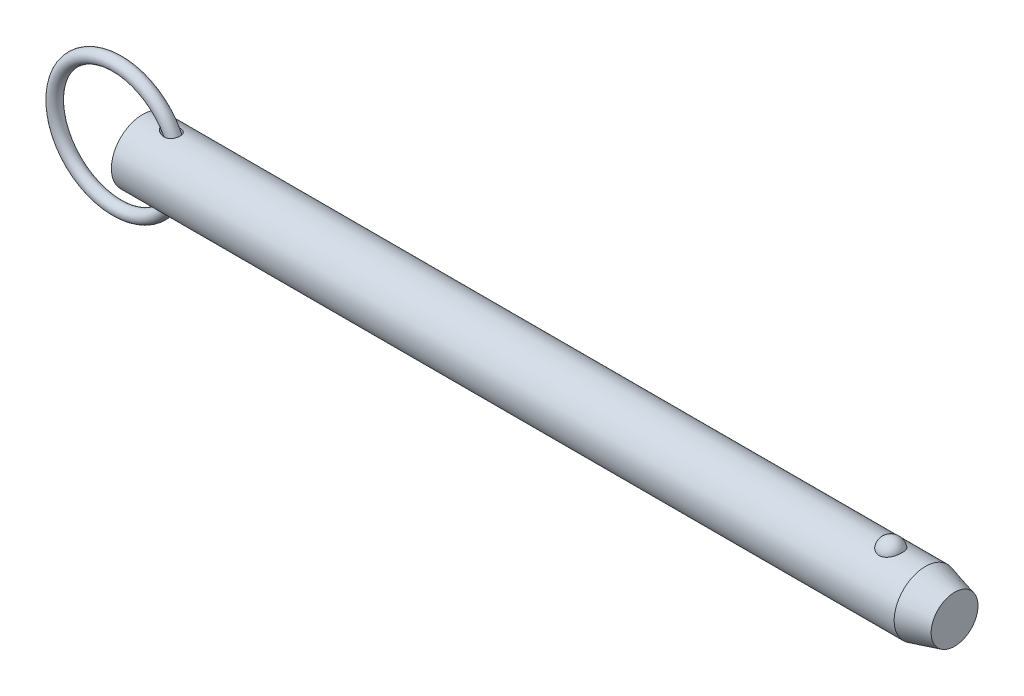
ISO-10303-21;
HEADER;
FILE_DESCRIPTION(('STEP AP214'),'2;1');
FILE_NAME('part.step','',(''),(''),'','','');
FILE_SCHEMA(('AUTOMOTIVE_DESIGN { 1 0 10303 214 1 1 1 1 }'));
ENDSEC;
DATA;
#1=APPLICATION_CONTEXT('core data for automotive mechanical design processes');
#2=APPLICATION_PROTOCOL_DEFINITION('international standard','automotive_design',2000,#1);
#3=PRODUCT_CONTEXT('',#1,'mechanical');
#4=PRODUCT('Part','Part','',(#3));
#5=PRODUCT_RELATED_PRODUCT_CATEGORY('part','',(#4));
#6=PRODUCT_DEFINITION_FORMATION('','',#4);
#7=PRODUCT_DEFINITION_CONTEXT('part definition',#1,'design');
#8=PRODUCT_DEFINITION('design','',#6,#7);
#9=PRODUCT_DEFINITION_SHAPE('','',#8);
#10=(LENGTH_UNIT() NAMED_UNIT(*) SI_UNIT(.MILLI.,.METRE.));
#11=(NAMED_UNIT(*) PLANE_ANGLE_UNIT() SI_UNIT($,.RADIAN.));
#12=(NAMED_UNIT(*) SI_UNIT($,.STERADIAN.) SOLID_ANGLE_UNIT());
#13=UNCERTAINTY_MEASURE_WITH_UNIT(LENGTH_MEASURE(1.E-05),#10,'distance_accuracy_value','');
#14=(GEOMETRIC_REPRESENTATION_CONTEXT(3) GLOBAL_UNCERTAINTY_ASSIGNED_CONTEXT((#13)) GLOBAL_UNIT_ASSIGNED_CONTEXT((#10,
#11,#12)) REPRESENTATION_CONTEXT('',''));
#15=CARTESIAN_POINT('',(0.,0.,0.));
#16=DIRECTION('',(0.,0.,1.));
#17=DIRECTION('',(1.,0.,0.));
#18=AXIS2_PLACEMENT_3D('',#15,#16,#17);
#19=CARTESIAN_POINT('',(-6.46799987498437,0.,0.));
#20=DIRECTION('',(0.,0.,1.));
#21=DIRECTION('',(1.,0.,0.));
#22=AXIS2_PLACEMENT_3D('',#19,#20,#21);
#23=TOROIDAL_SURFACE('',#22,15.875,1.588);
#24=CARTESIAN_POINT('',(10.9950001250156,0.,0.));
#25=VERTEX_POINT('',#24);
#26=VERTEX_LOOP('',#25);
#27=FACE_BOUND('',#26,.T.);
#28=ADVANCED_FACE('P0_F12',(#27),#23,.T.);
#29=CLOSED_SHELL('',(#28));
#30=MANIFOLD_SOLID_BREP('P0_B1',#29);
#31=CARTESIAN_POINT('',(0.,0.,0.));
#32=DIRECTION('',(1.,0.,0.));
#33=DIRECTION('',(0.,0.,-1.));
#34=AXIS2_PLACEMENT_3D('',#31,#32,#33);
#35=CYLINDRICAL_SURFACE('',#34,7.94);
#36=CARTESIAN_POINT('',(4.99454278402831,7.92831028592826,-0.430692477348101));
#37=CARTESIAN_POINT('',(5.02621962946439,7.92271974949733,-0.533554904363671));
#38=CARTESIAN_POINT('',(5.06869972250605,7.91528872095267,-0.633052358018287));
#39=CARTESIAN_POINT('',(5.17094751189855,7.89785690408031,-0.822566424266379));
#40=CARTESIAN_POINT('',(5.23077290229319,7.88784755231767,-0.912550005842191));
#41=CARTESIAN_POINT('',(5.37866013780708,7.8639674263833,-1.10117829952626));
#42=CARTESIAN_POINT('',(5.47004908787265,7.84973599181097,-1.19714712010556));
#43=CARTESIAN_POINT('',(5.66695490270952,7.82090787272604,-1.37293476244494));
#44=CARTESIAN_POINT('',(5.77247743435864,7.80631104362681,-1.45274707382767));
#45=CARTESIAN_POINT('',(5.99604254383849,7.77793596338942,-1.59776875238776));
#46=CARTESIAN_POINT('',(6.11428384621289,7.76417836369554,-1.66267404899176));
#47=CARTESIAN_POINT('',(6.35882685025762,7.73912410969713,-1.77564129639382));
#48=CARTESIAN_POINT('',(6.48513256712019,7.72782869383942,-1.82369477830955));
#49=CARTESIAN_POINT('',(6.76898453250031,7.70705630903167,-1.90977520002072));
#50=CARTESIAN_POINT('',(6.92778004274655,7.69837706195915,-1.94395681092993));
#51=CARTESIAN_POINT('',(7.24915504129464,7.6881294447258,-1.98412381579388));
#52=CARTESIAN_POINT('',(7.41173039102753,7.68655363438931,-1.99013871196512));
#53=CARTESIAN_POINT('',(7.697714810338,7.69094561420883,-1.97306069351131));
#54=CARTESIAN_POINT('',(7.82153338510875,7.69526202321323,-1.95634328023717));
#55=CARTESIAN_POINT('',(8.06460511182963,7.70859273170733,-1.90314615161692));
#56=CARTESIAN_POINT('',(8.18386164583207,7.7176034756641,-1.86668139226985));
#57=CARTESIAN_POINT('',(8.41450663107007,7.73959050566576,-1.77331230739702));
#58=CARTESIAN_POINT('',(8.52585042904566,7.75258738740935,-1.71630154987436));
#59=CARTESIAN_POINT('',(8.73575290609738,7.7809705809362,-1.58263416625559));
#60=CARTESIAN_POINT('',(8.83431445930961,7.7963563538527,-1.50598196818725));
#61=CARTESIAN_POINT('',(9.00639839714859,7.8259635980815,-1.34315626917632));
#62=CARTESIAN_POINT('',(9.08139772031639,7.84016008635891,-1.25853389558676));
#63=CARTESIAN_POINT('',(9.21545590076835,7.86710959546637,-1.07729126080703));
#64=CARTESIAN_POINT('',(9.27451869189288,7.87986297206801,-0.980673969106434));
#65=CARTESIAN_POINT('',(9.37315031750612,7.90198817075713,-0.782161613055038));
#66=CARTESIAN_POINT('',(9.41336512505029,7.91146854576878,-0.68059867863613));
#67=CARTESIAN_POINT('',(9.47650914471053,7.92664976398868,-0.471967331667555));
#68=CARTESIAN_POINT('',(9.49943917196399,7.93235078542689,-0.364899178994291));
#69=CARTESIAN_POINT('',(9.5274466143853,7.93934369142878,-0.14863226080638));
#70=CARTESIAN_POINT('',(9.53257574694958,7.9406483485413,-0.0394405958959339));
#71=CARTESIAN_POINT('',(9.52501411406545,7.93874464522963,0.178286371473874));
#72=CARTESIAN_POINT('',(9.51232314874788,7.93553623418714,0.286821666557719));
#73=CARTESIAN_POINT('',(9.46937875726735,7.92494527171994,0.500278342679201));
#74=CARTESIAN_POINT('',(9.43910562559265,7.9175580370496,0.605195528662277));
#75=CARTESIAN_POINT('',(9.36168926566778,7.8994090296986,0.808294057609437));
#76=CARTESIAN_POINT('',(9.3145467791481,7.88864740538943,0.906475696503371));
#77=CARTESIAN_POINT('',(9.20464679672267,7.86494645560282,1.09319438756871));
#78=CARTESIAN_POINT('',(9.14191093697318,7.85201015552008,1.18174456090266));
#79=CARTESIAN_POINT('',(9.00249124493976,7.82536913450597,1.34692675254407));
#80=CARTESIAN_POINT('',(8.92580850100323,7.81166447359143,1.42355969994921));
#81=CARTESIAN_POINT('',(8.76033130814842,7.78490157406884,1.56333296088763));
#82=CARTESIAN_POINT('',(8.67148512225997,7.77184644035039,1.62641250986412));
#83=CARTESIAN_POINT('',(8.48457694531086,7.74778101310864,1.73744892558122));
#84=CARTESIAN_POINT('',(8.38651410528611,7.73677090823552,1.78540439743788));
#85=CARTESIAN_POINT('',(8.18013312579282,7.71742695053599,1.86728938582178));
#86=CARTESIAN_POINT('',(8.07156725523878,7.7092102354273,1.90061897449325));
#87=CARTESIAN_POINT('',(7.85050876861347,7.6966502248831,1.95085652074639));
#88=CARTESIAN_POINT('',(7.73801453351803,7.69230854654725,1.967757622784));
#89=CARTESIAN_POINT('',(7.50002163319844,7.6873799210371,1.98693391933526));
#90=CARTESIAN_POINT('',(7.37438052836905,7.68722739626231,1.98751701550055));
#91=CARTESIAN_POINT('',(7.12435864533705,7.69142268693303,1.97121025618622));
#92=CARTESIAN_POINT('',(6.99997834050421,7.6957721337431,1.9543140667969));
#93=CARTESIAN_POINT('',(6.73521978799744,7.70925573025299,1.90049277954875));
#94=CARTESIAN_POINT('',(6.59543541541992,7.71903968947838,1.86081454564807));
#95=CARTESIAN_POINT('',(6.32319848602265,7.74233460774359,1.76138158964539));
#96=CARTESIAN_POINT('',(6.19076082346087,7.75585282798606,1.7015877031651));
#97=CARTESIAN_POINT('',(5.99269110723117,7.7785835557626,1.59336057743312));
#98=CARTESIAN_POINT('',(5.92332049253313,7.78707101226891,1.55151799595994));
#99=CARTESIAN_POINT('',(5.78862576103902,7.80440479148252,1.46183267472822));
#100=CARTESIAN_POINT('',(5.72330291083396,7.81325122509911,1.41398807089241));
#101=CARTESIAN_POINT('',(5.53492618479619,7.83980388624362,1.26162857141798));
#102=CARTESIAN_POINT('',(5.41884115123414,7.85759887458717,1.14795556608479));
#103=CARTESIAN_POINT('',(5.25731156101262,7.88350844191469,0.948390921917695));
#104=CARTESIAN_POINT('',(5.20241173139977,7.89260196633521,0.87019982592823));
#105=CARTESIAN_POINT('',(5.10541071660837,7.90897737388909,0.70602680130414));
#106=CARTESIAN_POINT('',(5.06329682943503,7.91626105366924,0.620052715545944));
#107=CARTESIAN_POINT('',(4.99458837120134,7.92827352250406,0.440665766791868));
#108=CARTESIAN_POINT('',(4.96816655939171,7.93297382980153,0.347182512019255));
#109=CARTESIAN_POINT('',(4.94275291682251,7.93751024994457,0.204498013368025));
#110=CARTESIAN_POINT('',(4.93665149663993,7.9386033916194,0.156529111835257));
#111=CARTESIAN_POINT('',(4.92932198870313,7.93991739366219,0.0602142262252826));
#112=CARTESIAN_POINT('',(4.92809242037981,7.94013851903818,0.011868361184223));
#113=CARTESIAN_POINT('',(4.93104052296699,7.93960920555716,-0.103241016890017));
#114=CARTESIAN_POINT('',(4.93747289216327,7.93845361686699,-0.169956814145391));
#115=CARTESIAN_POINT('',(4.95939910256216,7.93453812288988,-0.301777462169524));
#116=CARTESIAN_POINT('',(4.97489225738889,7.9317783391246,-0.36688243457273));
#117=CARTESIAN_POINT('',(4.99454278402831,7.92831028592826,-0.430692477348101));
#118=B_SPLINE_CURVE_WITH_KNOTS('',3,(#36,#37,#38,#39,#40,#41,#42,#43,#44,#45,#46,#47,#48,#49,
#50,#51,#52,#53,#54,#55,#56,#57,#58,#59,#60,#61,#62,#63,#64,#65,#66,#67,#68,#69,#70,#71,#72,#73,
#74,#75,#76,#77,#78,#79,#80,#81,#82,#83,#84,#85,#86,#87,#88,#89,#90,#91,#92,#93,#94,#95,#96,#97,
#98,#99,#100,#101,#102,#103,#104,#105,#106,#107,#108,#109,#110,#111,#112,#113,#114,#115,#116,
#117),.UNSPECIFIED.,.T.,.F.,(4,2,2,2,2,2,2,2,2,2,2,2,2,2,2,2,2,2,2,2,2,2,2,2,2,2,2,2,2,2,2,2,2,
2,2,2,2,2,2,2,4),(0.,0.323000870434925,0.647088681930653,1.04479679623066,1.4426648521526,
1.84804279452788,2.25362416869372,2.73917777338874,3.2242226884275,3.59772765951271,
3.97095014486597,4.34613445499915,4.72123425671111,5.06140749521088,5.40149668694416,
5.72887751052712,6.05624289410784,6.38265637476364,6.70907351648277,7.03585720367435,
7.36262652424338,7.68894495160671,8.01523792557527,8.34296459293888,8.67072147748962,
9.01089033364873,9.35120108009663,9.72668268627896,10.1023004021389,10.5375309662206,
10.9736138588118,11.2176803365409,11.461822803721,11.9480055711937,12.2349837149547,
12.5216758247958,12.8114683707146,12.9563497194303,13.1011870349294,13.3015737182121,
13.5019452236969),.UNSPECIFIED.);
#119=CARTESIAN_POINT('',(4.99454278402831,7.92831028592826,-0.430692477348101));
#120=VERTEX_POINT('',#119);
#121=EDGE_CURVE('P1_E40',#120,#120,#118,.T.);
#122=ORIENTED_EDGE('',*,*,#121,.T.);
#123=EDGE_LOOP('',(#122));
#124=FACE_BOUND('',#123,.T.);
#125=CARTESIAN_POINT('',(198.971879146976,0.,0.));
#126=DIRECTION('',(1.,0.,0.));
#127=DIRECTION('',(0.,0.,-1.));
#128=AXIS2_PLACEMENT_3D('',#125,#126,#127);
#129=CIRCLE('',#128,7.94);
#130=CARTESIAN_POINT('',(198.971879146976,0.,-7.94));
#131=VERTEX_POINT('',#130);
#132=EDGE_CURVE('P1_E25',#131,#131,#129,.T.);
#133=ORIENTED_EDGE('',*,*,#132,.F.);
#134=EDGE_LOOP('',(#133));
#135=FACE_BOUND('',#134,.T.);
#136=CARTESIAN_POINT('',(0.,0.,0.));
#137=DIRECTION('',(1.,0.,0.));
#138=DIRECTION('',(0.,0.,-1.));
#139=AXIS2_PLACEMENT_3D('',#136,#137,#138);
#140=CIRCLE('',#139,7.94);
#141=CARTESIAN_POINT('',(0.,0.,-7.94));
#142=VERTEX_POINT('',#141);
#143=EDGE_CURVE('P1_E9',#142,#142,#140,.T.);
#144=ORIENTED_EDGE('',*,*,#143,.T.);
#145=EDGE_LOOP('',(#144));
#146=FACE_BOUND('',#145,.T.);
#147=CARTESIAN_POINT('',(190.164907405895,7.37767842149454,2.93486986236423));
#148=CARTESIAN_POINT('',(190.012749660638,7.3776732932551,2.93487505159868));
#149=CARTESIAN_POINT('',(189.860632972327,7.38258419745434,2.92262454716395));
#150=CARTESIAN_POINT('',(189.560928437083,7.40163229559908,2.87404196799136));
#151=CARTESIAN_POINT('',(189.413339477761,7.41576720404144,2.83771585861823));
#152=CARTESIAN_POINT('',(189.127018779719,7.4516157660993,2.74218769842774));
#153=CARTESIAN_POINT('',(188.988274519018,7.47331841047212,2.68301886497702));
#154=CARTESIAN_POINT('',(188.722882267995,7.52194082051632,2.54350967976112));
#155=CARTESIAN_POINT('',(188.596236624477,7.54886159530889,2.46316523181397));
#156=CARTESIAN_POINT('',(188.354534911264,7.60594671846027,2.28090375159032));
#157=CARTESIAN_POINT('',(188.239906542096,7.63618114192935,2.1784421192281));
#158=CARTESIAN_POINT('',(188.028878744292,7.69614046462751,1.95608495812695));
#159=CARTESIAN_POINT('',(187.932482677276,7.72586526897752,1.83618622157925));
#160=CARTESIAN_POINT('',(187.755938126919,7.78314821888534,1.57628086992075));
#161=CARTESIAN_POINT('',(187.676707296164,7.81055035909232,1.43561546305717));
#162=CARTESIAN_POINT('',(187.541797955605,7.85879631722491,1.142363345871));
#163=CARTESIAN_POINT('',(187.486121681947,7.87963951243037,0.989775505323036));
#164=CARTESIAN_POINT('',(187.39881215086,7.91289645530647,0.674619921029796));
#165=CARTESIAN_POINT('',(187.36753090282,7.92518652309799,0.511941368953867));
#166=CARTESIAN_POINT('',(187.330975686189,7.93958930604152,0.183247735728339));
#167=CARTESIAN_POINT('',(187.325701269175,7.94170219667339,0.0172327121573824));
#168=CARTESIAN_POINT('',(187.341231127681,7.93554931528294,-0.312672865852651));
#169=CARTESIAN_POINT('',(187.361925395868,7.92732732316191,-0.476569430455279));
#170=CARTESIAN_POINT('',(187.42878655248,7.90141534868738,-0.798305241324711));
#171=CARTESIAN_POINT('',(187.474953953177,7.88372517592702,-0.956144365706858));
#172=CARTESIAN_POINT('',(187.591898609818,7.84066230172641,-1.26152073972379));
#173=CARTESIAN_POINT('',(187.662704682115,7.81528060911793,-1.40904568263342));
#174=CARTESIAN_POINT('',(187.827478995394,7.75948672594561,-1.68950598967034));
#175=CARTESIAN_POINT('',(187.921448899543,7.72907417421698,-1.82244030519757));
#176=CARTESIAN_POINT('',(188.130839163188,7.66640424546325,-2.07032792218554));
#177=CARTESIAN_POINT('',(188.246315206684,7.63414223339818,-2.18523308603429));
#178=CARTESIAN_POINT('',(188.4959006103,7.57149681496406,-2.39329737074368));
#179=CARTESIAN_POINT('',(188.630008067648,7.54111321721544,-2.48645870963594));
#180=CARTESIAN_POINT('',(188.910111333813,7.48650742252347,-2.64628132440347));
#181=CARTESIAN_POINT('',(189.055760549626,7.46215900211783,-2.71350554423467));
#182=CARTESIAN_POINT('',(189.357425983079,7.42171253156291,-2.82226614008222));
#183=CARTESIAN_POINT('',(189.513438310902,7.40561140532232,-2.86381209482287));
#184=CARTESIAN_POINT('',(189.822970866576,7.38426796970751,-2.9183907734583));
#185=CARTESIAN_POINT('',(189.976222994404,7.37852109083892,-2.93275024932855));
#186=CARTESIAN_POINT('',(190.283070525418,7.37700973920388,-2.93655208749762));
#187=CARTESIAN_POINT('',(190.436665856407,7.38124333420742,-2.92599927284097));
#188=CARTESIAN_POINT('',(190.734990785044,7.39890635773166,-2.88102897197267));
#189=CARTESIAN_POINT('',(190.879848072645,7.41205491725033,-2.84733999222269));
#190=CARTESIAN_POINT('',(191.16164329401,7.445801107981,-2.75788206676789));
#191=CARTESIAN_POINT('',(191.298580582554,7.46639934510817,-2.70211132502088));
#192=CARTESIAN_POINT('',(191.564061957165,7.51339098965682,-2.56858908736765));
#193=CARTESIAN_POINT('',(191.692354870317,7.53990200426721,-2.4903806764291));
#194=CARTESIAN_POINT('',(191.934244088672,7.59569503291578,-2.31462737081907));
#195=CARTESIAN_POINT('',(192.047837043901,7.6249776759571,-2.21707808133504));
#196=CARTESIAN_POINT('',(192.26322156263,7.68489473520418,-1.99982049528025));
#197=CARTESIAN_POINT('',(192.364148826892,7.71552419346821,-1.87925337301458));
#198=CARTESIAN_POINT('',(192.545186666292,7.77353016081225,-1.6226882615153));
#199=CARTESIAN_POINT('',(192.625293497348,7.80090608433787,-1.48668750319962));
#200=CARTESIAN_POINT('',(192.765361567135,7.85047992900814,-1.1981841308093));
#201=CARTESIAN_POINT('',(192.824587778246,7.87248183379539,-1.04529016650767));
#202=CARTESIAN_POINT('',(192.917982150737,7.90785114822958,-0.731080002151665));
#203=CARTESIAN_POINT('',(192.952149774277,7.92121837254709,-0.569763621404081));
#204=CARTESIAN_POINT('',(192.994795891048,7.93797834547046,-0.242812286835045));
#205=CARTESIAN_POINT('',(193.003204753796,7.94134405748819,-0.0771668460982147));
#206=CARTESIAN_POINT('',(192.993962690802,7.93767937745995,0.253276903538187));
#207=CARTESIAN_POINT('',(192.976312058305,7.93064910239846,0.418075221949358));
#208=CARTESIAN_POINT('',(192.915424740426,7.90695571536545,0.741525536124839));
#209=CARTESIAN_POINT('',(192.872281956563,7.8903279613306,0.900197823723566));
#210=CARTESIAN_POINT('',(192.76135358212,7.84916386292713,1.20759654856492));
#211=CARTESIAN_POINT('',(192.69356656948,7.82462706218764,1.35632241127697));
#212=CARTESIAN_POINT('',(192.534371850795,7.77006699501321,1.64032869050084));
#213=CARTESIAN_POINT('',(192.442861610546,7.74002008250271,1.7755471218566));
#214=CARTESIAN_POINT('',(192.238296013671,7.67774175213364,2.0280064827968));
#215=CARTESIAN_POINT('',(192.125241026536,7.64551037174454,2.14524772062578));
#216=CARTESIAN_POINT('',(191.880831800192,7.58265895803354,2.35778002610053));
#217=CARTESIAN_POINT('',(191.749583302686,7.5520309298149,2.45319004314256));
#218=CARTESIAN_POINT('',(191.471601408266,7.49579792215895,2.61999897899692));
#219=CARTESIAN_POINT('',(191.324867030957,7.47019326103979,2.69139637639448));
#220=CARTESIAN_POINT('',(191.012947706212,7.42622216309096,2.8105324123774));
#221=CARTESIAN_POINT('',(190.847220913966,7.40825002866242,2.85700910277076));
#222=CARTESIAN_POINT('',(190.509279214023,7.38398348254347,2.9191685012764));
#223=CARTESIAN_POINT('',(190.33706702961,7.3776842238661,2.93486399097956));
#224=CARTESIAN_POINT('',(190.164907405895,7.37767842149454,2.93486986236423));
#225=B_SPLINE_CURVE_WITH_KNOTS('',3,(#147,#148,#149,#150,#151,#152,#153,#154,#155,#156,#157,
#158,#159,#160,#161,#162,#163,#164,#165,#166,#167,#168,#169,#170,#171,#172,#173,#174,#175,#176,
#177,#178,#179,#180,#181,#182,#183,#184,#185,#186,#187,#188,#189,#190,#191,#192,#193,#194,#195,
#196,#197,#198,#199,#200,#201,#202,#203,#204,#205,#206,#207,#208,#209,#210,#211,#212,#213,#214,
#215,#216,#217,#218,#219,#220,#221,#222,#223,#224),.UNSPECIFIED.,.T.,.F.,(4,2,2,2,2,2,2,2,2,2,2,
2,2,2,2,2,2,2,2,2,2,2,2,2,2,2,2,2,2,2,2,2,2,2,2,2,2,2,4),(0.,0.455841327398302,
0.911569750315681,1.36663794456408,1.82179423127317,2.2897898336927,2.75787163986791,
3.24685368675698,3.73588214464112,4.23184282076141,4.72779494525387,5.22165321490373,
5.71552141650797,6.20996917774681,6.7044524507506,7.20023431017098,7.69596557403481,
8.18023418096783,8.66432203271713,9.12410697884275,9.58380291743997,10.0296503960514,
10.4755341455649,10.9312349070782,11.3870393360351,11.8654416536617,12.3439299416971,
12.8378875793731,13.3318558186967,13.8271581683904,14.3224549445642,14.8159385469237,
15.3094506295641,15.8051323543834,16.3008055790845,16.7937101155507,17.2866458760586,
17.8026240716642,18.3183879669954),.UNSPECIFIED.);
#226=CARTESIAN_POINT('',(190.164907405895,7.37767842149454,2.93486986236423));
#227=VERTEX_POINT('',#226);
#228=EDGE_CURVE('P1_E34',#227,#227,#225,.T.);
#229=ORIENTED_EDGE('',*,*,#228,.T.);
#230=EDGE_LOOP('',(#229));
#231=FACE_BOUND('',#230,.T.);
#232=CARTESIAN_POINT('',(4.99454278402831,-7.92831028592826,-0.430692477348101));
#233=CARTESIAN_POINT('',(4.97033227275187,-7.93258231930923,-0.352006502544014));
#234=CARTESIAN_POINT('',(4.95238785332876,-7.93578782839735,-0.271213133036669));
#235=CARTESIAN_POINT('',(4.93055628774,-7.93969351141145,-0.107590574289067));
#236=CARTESIAN_POINT('',(4.92668686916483,-7.9403905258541,-0.0247589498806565));
#237=CARTESIAN_POINT('',(4.9333808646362,-7.93918950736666,0.140249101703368));
#238=CARTESIAN_POINT('',(4.94393526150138,-7.93729309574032,0.222425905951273));
#239=CARTESIAN_POINT('',(4.97854187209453,-7.93113325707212,0.383746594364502));
#240=CARTESIAN_POINT('',(5.00259804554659,-7.92686913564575,0.462889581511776));
#241=CARTESIAN_POINT('',(5.06904511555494,-7.91526143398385,0.633278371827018));
#242=CARTESIAN_POINT('',(5.11430124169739,-7.90744739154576,0.723368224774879));
#243=CARTESIAN_POINT('',(5.21873327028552,-7.88988375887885,0.894880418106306));
#244=CARTESIAN_POINT('',(5.27793532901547,-7.88013053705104,0.976286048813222));
#245=CARTESIAN_POINT('',(5.42949971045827,-7.85602233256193,1.15646341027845));
#246=CARTESIAN_POINT('',(5.52624420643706,-7.84124381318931,1.25147911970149));
#247=CARTESIAN_POINT('',(5.73364751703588,-7.81163164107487,1.42469165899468));
#248=CARTESIAN_POINT('',(5.84432059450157,-7.79679794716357,1.50287102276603));
#249=CARTESIAN_POINT('',(6.07871104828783,-7.76824211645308,1.64418004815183));
#250=CARTESIAN_POINT('',(6.20267992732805,-7.75455572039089,1.70689813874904));
#251=CARTESIAN_POINT('',(6.45850163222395,-7.73013259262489,1.81429879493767));
#252=CARTESIAN_POINT('',(6.59035778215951,-7.71939711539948,1.85897369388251));
#253=CARTESIAN_POINT('',(6.88209177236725,-7.70072462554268,1.93500734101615));
#254=CARTESIAN_POINT('',(7.04295460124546,-7.69356120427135,1.96286607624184));
#255=CARTESIAN_POINT('',(7.36724421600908,-7.68676336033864,1.98935053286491));
#256=CARTESIAN_POINT('',(7.53066723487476,-7.68711875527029,1.98801578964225));
#257=CARTESIAN_POINT('',(7.81370255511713,-7.69496475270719,1.95735673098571));
#258=CARTESIAN_POINT('',(7.93413357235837,-7.70066491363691,1.93505220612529));
#259=CARTESIAN_POINT('',(8.16950597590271,-7.71642704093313,1.87121573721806));
#260=CARTESIAN_POINT('',(8.28445128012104,-7.72648584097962,1.82969774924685));
#261=CARTESIAN_POINT('',(8.50557964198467,-7.75006886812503,1.72707806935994));
#262=CARTESIAN_POINT('',(8.61171927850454,-7.76360905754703,1.66588583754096));
#263=CARTESIAN_POINT('',(8.810712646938,-7.79249659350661,1.52503518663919));
#264=CARTESIAN_POINT('',(8.90356827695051,-7.80784368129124,1.44537941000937));
#265=CARTESIAN_POINT('',(9.06550151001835,-7.83702302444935,1.27723027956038));
#266=CARTESIAN_POINT('',(9.1359139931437,-7.85087516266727,1.19002179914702));
#267=CARTESIAN_POINT('',(9.26060432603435,-7.87675706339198,1.00451336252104));
#268=CARTESIAN_POINT('',(9.31488561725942,-7.88878721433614,0.906215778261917));
#269=CARTESIAN_POINT('',(9.40446618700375,-7.90930761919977,0.70456335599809));
#270=CARTESIAN_POINT('',(9.44028687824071,-7.91789338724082,0.601449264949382));
#271=CARTESIAN_POINT('',(9.49451523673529,-7.93109531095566,0.390496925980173));
#272=CARTESIAN_POINT('',(9.51292345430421,-7.93571159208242,0.282658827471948));
#273=CARTESIAN_POINT('',(9.53189686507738,-7.94047189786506,0.0654759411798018));
#274=CARTESIAN_POINT('',(9.53248611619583,-7.94062195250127,-0.0438666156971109));
#275=CARTESIAN_POINT('',(9.51587068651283,-7.93644929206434,-0.26110665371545));
#276=CARTESIAN_POINT('',(9.49866585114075,-7.93212653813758,-0.369004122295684));
#277=CARTESIAN_POINT('',(9.44682594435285,-7.91946859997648,-0.58038072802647));
#278=CARTESIAN_POINT('',(9.412176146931,-7.91113002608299,-0.683856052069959));
#279=CARTESIAN_POINT('',(9.32626198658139,-7.89134774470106,-0.883337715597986));
#280=CARTESIAN_POINT('',(9.27499851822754,-7.87990420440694,-0.979344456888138));
#281=CARTESIAN_POINT('',(9.15725058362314,-7.8551872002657,-1.1610523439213));
#282=CARTESIAN_POINT('',(9.09078836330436,-7.84191642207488,-1.24676827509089));
#283=CARTESIAN_POINT('',(8.94443523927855,-7.81498501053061,-1.40574704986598));
#284=CARTESIAN_POINT('',(8.86454527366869,-7.80132440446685,-1.47901076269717));
#285=CARTESIAN_POINT('',(8.69307774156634,-7.77497848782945,-1.61181253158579));
#286=CARTESIAN_POINT('',(8.60142539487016,-7.76230033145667,-1.67125525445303));
#287=CARTESIAN_POINT('',(8.40957687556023,-7.73928987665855,-1.77477159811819));
#288=CARTESIAN_POINT('',(8.30937953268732,-7.72895790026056,-1.81884310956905));
#289=CARTESIAN_POINT('',(8.0986350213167,-7.71113842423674,-1.89300673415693));
#290=CARTESIAN_POINT('',(7.98782526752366,-7.70379913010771,-1.92238394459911));
#291=CARTESIAN_POINT('',(7.76294389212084,-7.69313871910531,-1.96460780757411));
#292=CARTESIAN_POINT('',(7.64887102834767,-7.68981915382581,-1.9774480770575));
#293=CARTESIAN_POINT('',(7.40716929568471,-7.68706358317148,-1.98813881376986));
#294=CARTESIAN_POINT('',(7.27945620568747,-7.68810537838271,-1.98414471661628));
#295=CARTESIAN_POINT('',(7.02593945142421,-7.6946815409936,-1.95847707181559));
#296=CARTESIAN_POINT('',(6.90013720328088,-7.7002190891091,-1.93679100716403));
#297=CARTESIAN_POINT('',(6.63265145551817,-7.71617635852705,-1.87230070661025));
#298=CARTESIAN_POINT('',(6.49169161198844,-7.72724102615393,-1.82664736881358));
#299=CARTESIAN_POINT('',(6.21840602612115,-7.75282261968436,-1.71482542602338));
#300=CARTESIAN_POINT('',(6.08608498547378,-7.76734140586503,-1.64864576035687));
#301=CARTESIAN_POINT('',(5.84453114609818,-7.7967744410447,-1.50297952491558));
#302=CARTESIAN_POINT('',(5.73429128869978,-7.81154606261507,-1.4251373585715));
#303=CARTESIAN_POINT('',(5.52761180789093,-7.84104229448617,-1.25271210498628));
#304=CARTESIAN_POINT('',(5.43116004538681,-7.85576693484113,-1.15814390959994));
#305=CARTESIAN_POINT('',(5.27970568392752,-7.87984260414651,-0.978603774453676));
#306=CARTESIAN_POINT('',(5.22040249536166,-7.88960721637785,-0.897319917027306));
#307=CARTESIAN_POINT('',(5.11583115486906,-7.90718602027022,-0.726171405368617));
#308=CARTESIAN_POINT('',(5.07050564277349,-7.9150081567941,-0.636343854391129));
#309=CARTESIAN_POINT('',(5.01937588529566,-7.92393751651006,-0.506165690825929));
#310=CARTESIAN_POINT('',(5.00622932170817,-7.926248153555,-0.468674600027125));
#311=CARTESIAN_POINT('',(4.99454278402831,-7.92831028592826,-0.430692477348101));
#312=B_SPLINE_CURVE_WITH_KNOTS('',3,(#232,#233,#234,#235,#236,#237,#238,#239,#240,#241,#242,
#243,#244,#245,#246,#247,#248,#249,#250,#251,#252,#253,#254,#255,#256,#257,#258,#259,#260,#261,
#262,#263,#264,#265,#266,#267,#268,#269,#270,#271,#272,#273,#274,#275,#276,#277,#278,#279,#280,
#281,#282,#283,#284,#285,#286,#287,#288,#289,#290,#291,#292,#293,#294,#295,#296,#297,#298,#299,
#300,#301,#302,#303,#304,#305,#306,#307,#308,#309,#310,#311),.UNSPECIFIED.,.T.,.F.,(4,2,2,2,2,2,
2,2,2,2,2,2,2,2,2,2,2,2,2,2,2,2,2,2,2,2,2,2,2,2,2,2,2,2,2,2,2,2,2,4),(0.,0.247186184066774,
0.494683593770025,0.742026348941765,0.989441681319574,1.29115800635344,1.59344478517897,
2.00047108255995,2.40791761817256,2.82525860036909,3.2427767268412,3.7304673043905,
4.21749746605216,4.58380730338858,4.94985148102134,5.31760488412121,5.68530568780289,
6.02244390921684,6.35951015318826,6.68644714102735,7.01337379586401,7.33985903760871,
7.66634711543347,7.9931112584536,8.31985780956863,8.64612913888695,8.97237768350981,
9.30081392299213,9.62929521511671,9.9724956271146,10.3158284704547,10.6977037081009,
11.0798493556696,11.523823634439,11.9680375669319,12.3738595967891,12.7793221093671,
13.0815405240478,13.3825016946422,13.5018197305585),.UNSPECIFIED.);
#313=CARTESIAN_POINT('',(4.99454278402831,-7.92831028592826,-0.430692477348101));
#314=VERTEX_POINT('',#313);
#315=EDGE_CURVE('P1_E17',#314,#314,#312,.T.);
#316=ORIENTED_EDGE('',*,*,#315,.T.);
#317=EDGE_LOOP('',(#316));
#318=FACE_BOUND('',#317,.T.);
#319=ADVANCED_FACE('P1_F13',(#124,#135,#146,#231,#318),#35,.T.);
#320=CARTESIAN_POINT('',(0.,0.,0.));
#321=DIRECTION('',(-1.,0.,0.));
#322=DIRECTION('',(0.,0.,1.));
#323=AXIS2_PLACEMENT_3D('',#320,#321,#322);
#324=PLANE('',#323);
#325=ORIENTED_EDGE('',*,*,#143,.F.);
#326=EDGE_LOOP('',(#325));
#327=FACE_BOUND('',#326,.T.);
#328=ADVANCED_FACE('P1_F15',(#327),#324,.T.);
#329=CARTESIAN_POINT('',(206.38,0.,0.));
#330=DIRECTION('',(-1.,0.,0.));
#331=DIRECTION('',(0.,0.,1.));
#332=AXIS2_PLACEMENT_3D('',#329,#330,#331);
#333=CONICAL_SURFACE('',#332,5.95500000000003,0.261799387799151);
#334=ORIENTED_EDGE('',*,*,#132,.T.);
#335=EDGE_LOOP('',(#334));
#336=FACE_BOUND('',#335,.T.);
#337=CARTESIAN_POINT('',(206.38,0.,0.));
#338=DIRECTION('',(1.,0.,0.));
#339=DIRECTION('',(0.,0.,-1.));
#340=AXIS2_PLACEMENT_3D('',#337,#338,#339);
#341=CIRCLE('',#340,5.95500000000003);
#342=CARTESIAN_POINT('',(206.38,0.,-5.95500000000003));
#343=VERTEX_POINT('',#342);
#344=EDGE_CURVE('P1_E30',#343,#343,#341,.T.);
#345=ORIENTED_EDGE('',*,*,#344,.F.);
#346=EDGE_LOOP('',(#345));
#347=FACE_BOUND('',#346,.T.);
#348=ADVANCED_FACE('P1_F55',(#336,#347),#333,.T.);
#349=CARTESIAN_POINT('',(206.38,5.95500000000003,0.));
#350=DIRECTION('',(1.,0.,0.));
#351=DIRECTION('',(0.,0.,-1.));
#352=AXIS2_PLACEMENT_3D('',#349,#350,#351);
#353=PLANE('',#352);
#354=ORIENTED_EDGE('',*,*,#344,.T.);
#355=EDGE_LOOP('',(#354));
#356=FACE_BOUND('',#355,.T.);
#357=ADVANCED_FACE('P1_F51',(#356),#353,.T.);
#358=CARTESIAN_POINT('',(190.164907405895,7.146,0.));
#359=DIRECTION('',(-1.,0.,0.));
#360=DIRECTION('',(0.,1.,0.));
#361=AXIS2_PLACEMENT_3D('',#358,#359,#360);
#362=SPHERICAL_SURFACE('',#361,2.944);
#363=ORIENTED_EDGE('',*,*,#228,.F.);
#364=EDGE_LOOP('',(#363));
#365=FACE_BOUND('',#364,.T.);
#366=ADVANCED_FACE('P1_F46',(#365),#362,.T.);
#367=CARTESIAN_POINT('',(-6.46799987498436,0.,0.));
#368=DIRECTION('',(0.,0.,1.));
#369=DIRECTION('',(1.,0.,0.));
#370=AXIS2_PLACEMENT_3D('',#367,#368,#369);
#371=TOROIDAL_SURFACE('',#370,15.875,1.985);
#372=ORIENTED_EDGE('',*,*,#315,.F.);
#373=EDGE_LOOP('',(#372));
#374=FACE_BOUND('',#373,.T.);
#375=ORIENTED_EDGE('',*,*,#121,.F.);
#376=EDGE_LOOP('',(#375));
#377=FACE_BOUND('',#376,.T.);
#378=ADVANCED_FACE('P1_F50',(#374,#377),#371,.F.);
#379=CLOSED_SHELL('',(#319,#328,#348,#357,#366,#378));
#380=MANIFOLD_SOLID_BREP('P1_B1',#379);
#381=ADVANCED_BREP_SHAPE_REPRESENTATION('',(#18,#30,#380),#14);
#382=SHAPE_DEFINITION_REPRESENTATION(#9,#381);
ENDSEC;
END-ISO-10303-21;
